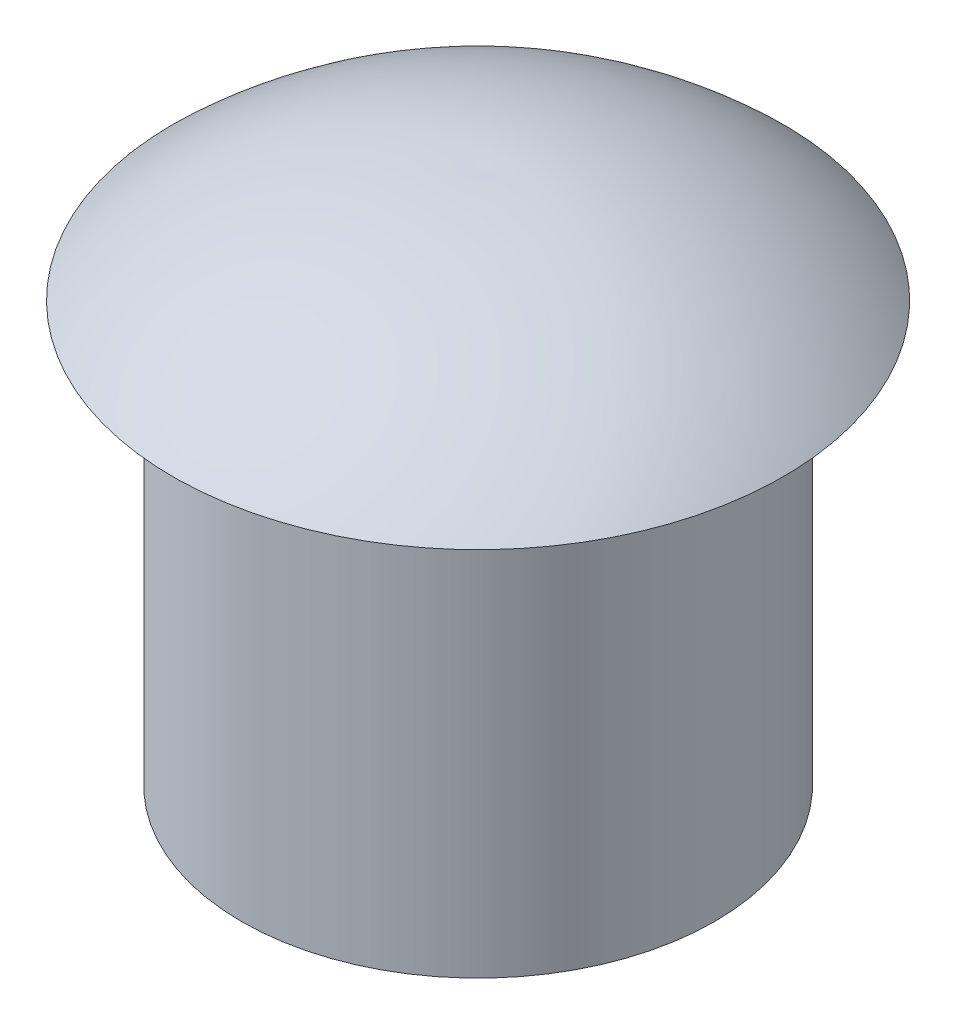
ISO-10303-21;
HEADER;
FILE_DESCRIPTION(('STEP AP214'),'2;1');
FILE_NAME('part.step','',(''),(''),'','','');
FILE_SCHEMA(('AUTOMOTIVE_DESIGN { 1 0 10303 214 1 1 1 1 }'));
ENDSEC;
DATA;
#1=APPLICATION_CONTEXT('core data for automotive mechanical design processes');
#2=APPLICATION_PROTOCOL_DEFINITION('international standard','automotive_design',2000,#1);
#3=PRODUCT_CONTEXT('',#1,'mechanical');
#4=PRODUCT('Part','Part','',(#3));
#5=PRODUCT_RELATED_PRODUCT_CATEGORY('part','',(#4));
#6=PRODUCT_DEFINITION_FORMATION('','',#4);
#7=PRODUCT_DEFINITION_CONTEXT('part definition',#1,'design');
#8=PRODUCT_DEFINITION('design','',#6,#7);
#9=PRODUCT_DEFINITION_SHAPE('','',#8);
#10=(LENGTH_UNIT() NAMED_UNIT(*) SI_UNIT(.MILLI.,.METRE.));
#11=(NAMED_UNIT(*) PLANE_ANGLE_UNIT() SI_UNIT($,.RADIAN.));
#12=(NAMED_UNIT(*) SI_UNIT($,.STERADIAN.) SOLID_ANGLE_UNIT());
#13=UNCERTAINTY_MEASURE_WITH_UNIT(LENGTH_MEASURE(1.E-05),#10,'distance_accuracy_value','');
#14=(GEOMETRIC_REPRESENTATION_CONTEXT(3) GLOBAL_UNCERTAINTY_ASSIGNED_CONTEXT((#13)) GLOBAL_UNIT_ASSIGNED_CONTEXT((#10,
#11,#12)) REPRESENTATION_CONTEXT('',''));
#15=CARTESIAN_POINT('',(0.,0.,0.));
#16=DIRECTION('',(0.,0.,1.));
#17=DIRECTION('',(1.,0.,0.));
#18=AXIS2_PLACEMENT_3D('',#15,#16,#17);
#19=CARTESIAN_POINT('',(-0.178618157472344,-5.60701824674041,0.));
#20=DIRECTION('',(0.,0.,-1.));
#21=DIRECTION('',(-1.,0.,0.));
#22=AXIS2_PLACEMENT_3D('',#19,#20,#21);
#23=CIRCLE('',#22,5.60986257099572);
#24=TRIMMED_CURVE('',#23,(PARAMETER_VALUE(-1.60264173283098)),
(PARAMETER_VALUE(1.60264173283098)),.T.,.PARAMETER.);
#25=CARTESIAN_POINT('',(0.,-5.60701824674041,0.));
#26=DIRECTION('',(0.,1.,0.));
#27=AXIS1_PLACEMENT('',#25,#26);
#28=SURFACE_OF_REVOLUTION('',#24,#27);
#29=CARTESIAN_POINT('',(0.,0.,0.));
#30=VERTEX_POINT('',#29);
#31=VERTEX_LOOP('',#30);
#32=FACE_BOUND('',#31,.T.);
#33=CARTESIAN_POINT('',(0.,-1.5,0.));
#34=DIRECTION('',(0.,1.,0.));
#35=DIRECTION('',(-1.,0.,0.));
#36=AXIS2_PLACEMENT_3D('',#33,#34,#35);
#37=CIRCLE('',#36,4.);
#38=CARTESIAN_POINT('',(-4.,-1.5,0.));
#39=VERTEX_POINT('',#38);
#40=EDGE_CURVE('E19',#39,#39,#37,.F.);
#41=ORIENTED_EDGE('',*,*,#40,.F.);
#42=EDGE_LOOP('',(#41));
#43=FACE_BOUND('',#42,.T.);
#44=ADVANCED_FACE('F16',(#32,#43),#28,.T.);
#45=CARTESIAN_POINT('',(1.55,-7.,0.));
#46=DIRECTION('',(0.,-1.,0.));
#47=DIRECTION('',(0.,0.,-1.));
#48=AXIS2_PLACEMENT_3D('',#45,#46,#47);
#49=PLANE('',#48);
#50=CARTESIAN_POINT('',(0.,-7.,0.));
#51=DIRECTION('',(0.,-1.,0.));
#52=DIRECTION('',(1.,0.,0.));
#53=AXIS2_PLACEMENT_3D('',#50,#51,#52);
#54=CIRCLE('',#53,3.1);
#55=CARTESIAN_POINT('',(3.1,-7.,0.));
#56=VERTEX_POINT('',#55);
#57=EDGE_CURVE('E23',#56,#56,#54,.F.);
#58=ORIENTED_EDGE('',*,*,#57,.F.);
#59=EDGE_LOOP('',(#58));
#60=FACE_BOUND('',#59,.T.);
#61=ADVANCED_FACE('F29',(#60),#49,.T.);
#62=CARTESIAN_POINT('',(3.55,-1.5,0.));
#63=DIRECTION('',(0.,-1.,0.));
#64=DIRECTION('',(0.,0.,-1.));
#65=AXIS2_PLACEMENT_3D('',#62,#63,#64);
#66=PLANE('',#65);
#67=CARTESIAN_POINT('',(0.,-1.5,0.));
#68=DIRECTION('',(0.,-1.,0.));
#69=DIRECTION('',(1.,0.,0.));
#70=AXIS2_PLACEMENT_3D('',#67,#68,#69);
#71=CIRCLE('',#70,3.1);
#72=CARTESIAN_POINT('',(3.1,-1.5,0.));
#73=VERTEX_POINT('',#72);
#74=EDGE_CURVE('E11',#73,#73,#71,.T.);
#75=ORIENTED_EDGE('',*,*,#74,.F.);
#76=EDGE_LOOP('',(#75));
#77=FACE_BOUND('',#76,.T.);
#78=ORIENTED_EDGE('',*,*,#40,.T.);
#79=EDGE_LOOP('',(#78));
#80=FACE_BOUND('',#79,.T.);
#81=ADVANCED_FACE('F39',(#77,#80),#66,.T.);
#82=CARTESIAN_POINT('',(0.,-4.25,0.));
#83=DIRECTION('',(0.,-1.,0.));
#84=DIRECTION('',(1.,0.,0.));
#85=AXIS2_PLACEMENT_3D('',#82,#83,#84);
#86=CYLINDRICAL_SURFACE('',#85,3.1);
#87=ORIENTED_EDGE('',*,*,#74,.T.);
#88=EDGE_LOOP('',(#87));
#89=FACE_BOUND('',#88,.T.);
#90=ORIENTED_EDGE('',*,*,#57,.T.);
#91=EDGE_LOOP('',(#90));
#92=FACE_BOUND('',#91,.T.);
#93=ADVANCED_FACE('F36',(#89,#92),#86,.T.);
#94=CLOSED_SHELL('',(#44,#61,#81,#93));
#95=MANIFOLD_SOLID_BREP('B1',#94);
#96=ADVANCED_BREP_SHAPE_REPRESENTATION('',(#18,#95),#14);
#97=SHAPE_DEFINITION_REPRESENTATION(#9,#96);
ENDSEC;
END-ISO-10303-21;
